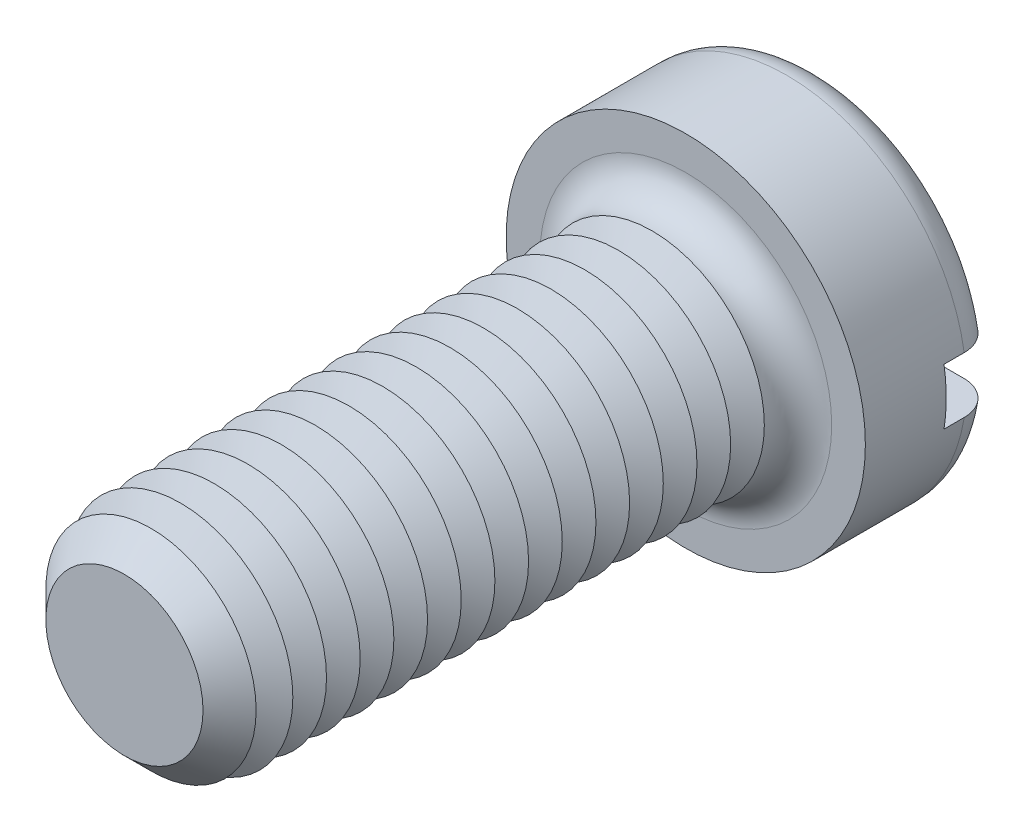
ISO-10303-21;
HEADER;
FILE_DESCRIPTION(('STEP AP214'),'2;1');
FILE_NAME('part.step','',(''),(''),'','','');
FILE_SCHEMA(('AUTOMOTIVE_DESIGN { 1 0 10303 214 1 1 1 1 }'));
ENDSEC;
DATA;
#1=APPLICATION_CONTEXT('core data for automotive mechanical design processes');
#2=APPLICATION_PROTOCOL_DEFINITION('international standard','automotive_design',2000,#1);
#3=PRODUCT_CONTEXT('',#1,'mechanical');
#4=PRODUCT('Part','Part','',(#3));
#5=PRODUCT_RELATED_PRODUCT_CATEGORY('part','',(#4));
#6=PRODUCT_DEFINITION_FORMATION('','',#4);
#7=PRODUCT_DEFINITION_CONTEXT('part definition',#1,'design');
#8=PRODUCT_DEFINITION('design','',#6,#7);
#9=PRODUCT_DEFINITION_SHAPE('','',#8);
#10=(LENGTH_UNIT() NAMED_UNIT(*) SI_UNIT(.MILLI.,.METRE.));
#11=(NAMED_UNIT(*) PLANE_ANGLE_UNIT() SI_UNIT($,.RADIAN.));
#12=(NAMED_UNIT(*) SI_UNIT($,.STERADIAN.) SOLID_ANGLE_UNIT());
#13=UNCERTAINTY_MEASURE_WITH_UNIT(LENGTH_MEASURE(1.E-05),#10,'distance_accuracy_value','');
#14=(GEOMETRIC_REPRESENTATION_CONTEXT(3) GLOBAL_UNCERTAINTY_ASSIGNED_CONTEXT((#13)) GLOBAL_UNIT_ASSIGNED_CONTEXT((#10,
#11,#12)) REPRESENTATION_CONTEXT('',''));
#15=CARTESIAN_POINT('',(0.,0.,0.));
#16=DIRECTION('',(0.,0.,1.));
#17=DIRECTION('',(1.,0.,0.));
#18=AXIS2_PLACEMENT_3D('',#15,#16,#17);
#19=CARTESIAN_POINT('',(0.,0.,-6.));
#20=DIRECTION('',(0.,0.,1.));
#21=DIRECTION('',(1.,0.,0.));
#22=AXIS2_PLACEMENT_3D('',#19,#20,#21);
#23=PLANE('',#22);
#24=CARTESIAN_POINT('',(0.,0.,-6.));
#25=DIRECTION('',(0.,0.,1.));
#26=DIRECTION('',(1.,0.,0.));
#27=AXIS2_PLACEMENT_3D('',#24,#25,#26);
#28=CIRCLE('',#27,6.5);
#29=CARTESIAN_POINT('',(-6.37867541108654,1.25,-6.));
#30=VERTEX_POINT('',#29);
#31=CARTESIAN_POINT('',(6.37867541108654,1.25,-6.));
#32=VERTEX_POINT('',#31);
#33=EDGE_CURVE('E116',#30,#32,#28,.F.);
#34=ORIENTED_EDGE('',*,*,#33,.T.);
#35=DIRECTION('',(1.,0.,0.));
#36=VECTOR('',#35,1.);
#37=CARTESIAN_POINT('',(-8.,1.25,-6.));
#38=LINE('',#37,#36);
#39=EDGE_CURVE('E111',#30,#32,#38,.T.);
#40=ORIENTED_EDGE('',*,*,#39,.F.);
#41=EDGE_LOOP('',(#34,#40));
#42=FACE_BOUND('',#41,.T.);
#43=ADVANCED_FACE('F39',(#42),#23,.F.);
#44=CARTESIAN_POINT('',(0.,0.,-4.5));
#45=DIRECTION('',(0.,0.,1.));
#46=DIRECTION('',(1.,0.,0.));
#47=AXIS2_PLACEMENT_3D('',#44,#45,#46);
#48=TOROIDAL_SURFACE('',#47,6.5,1.5);
#49=CARTESIAN_POINT('',(-7.63778128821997,1.25,-5.34492908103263));
#50=CARTESIAN_POINT('',(-7.58949199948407,1.25,-5.41482553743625));
#51=CARTESIAN_POINT('',(-7.53520056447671,1.25,-5.48065698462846));
#52=CARTESIAN_POINT('',(-7.41624971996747,1.25,-5.60228223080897));
#53=CARTESIAN_POINT('',(-7.35157642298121,1.25,-5.65806236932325));
#54=CARTESIAN_POINT('',(-7.21387612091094,1.25,-5.75795436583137));
#55=CARTESIAN_POINT('',(-7.14085828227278,1.25,-5.80207885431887));
#56=CARTESIAN_POINT('',(-6.98853766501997,1.25,-5.87758013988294));
#57=CARTESIAN_POINT('',(-6.90923642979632,1.25,-5.90896005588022));
#58=CARTESIAN_POINT('',(-6.74565677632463,1.25,-5.95849861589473));
#59=CARTESIAN_POINT('',(-6.66133328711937,1.25,-5.97650838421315));
#60=CARTESIAN_POINT('',(-6.49086565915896,1.25,-5.99833509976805));
#61=CARTESIAN_POINT('',(-6.40472129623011,1.25,-6.00215028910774));
#62=CARTESIAN_POINT('',(-6.23174891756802,1.25,-5.99550457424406));
#63=CARTESIAN_POINT('',(-6.14492874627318,1.25,-5.98483870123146));
#64=CARTESIAN_POINT('',(-5.97427268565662,1.25,-5.94920077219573));
#65=CARTESIAN_POINT('',(-5.89043699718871,1.25,-5.92422775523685));
#66=CARTESIAN_POINT('',(-5.72747580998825,1.25,-5.86041051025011));
#67=CARTESIAN_POINT('',(-5.64839123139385,1.25,-5.8214616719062));
#68=CARTESIAN_POINT('',(-5.49793182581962,1.25,-5.73076137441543));
#69=CARTESIAN_POINT('',(-5.42655700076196,1.25,-5.6790099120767));
#70=CARTESIAN_POINT('',(-5.29410028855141,1.25,-5.56444713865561));
#71=CARTESIAN_POINT('',(-5.23295591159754,1.25,-5.50170815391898));
#72=CARTESIAN_POINT('',(-5.12236155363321,1.25,-5.36664720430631));
#73=CARTESIAN_POINT('',(-5.07291010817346,1.25,-5.29432644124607));
#74=CARTESIAN_POINT('',(-4.98836421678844,1.25,-5.14389152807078));
#75=CARTESIAN_POINT('',(-4.95296843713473,1.25,-5.0659468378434));
#76=CARTESIAN_POINT('',(-4.89620356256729,1.25,-4.90510804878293));
#77=CARTESIAN_POINT('',(-4.87483169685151,1.25,-4.82221493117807));
#78=CARTESIAN_POINT('',(-4.8472995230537,1.25,-4.65636387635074));
#79=CARTESIAN_POINT('',(-4.84072446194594,1.25,-4.57347463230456));
#80=CARTESIAN_POINT('',(-4.84179430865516,1.25,-4.40779255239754));
#81=CARTESIAN_POINT('',(-4.84943782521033,1.25,-4.32499970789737));
#82=CARTESIAN_POINT('',(-4.87846819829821,1.25,-4.16301415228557));
#83=CARTESIAN_POINT('',(-4.89966978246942,1.25,-4.08378809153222));
#84=CARTESIAN_POINT('',(-4.95491528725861,1.25,-3.92995334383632));
#85=CARTESIAN_POINT('',(-4.98895983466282,1.25,-3.85534488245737));
#86=CARTESIAN_POINT('',(-5.06928242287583,1.25,-3.71183790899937));
#87=CARTESIAN_POINT('',(-5.11570495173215,1.25,-3.64302036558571));
#88=CARTESIAN_POINT('',(-5.21915370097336,1.25,-3.51388372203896));
#89=CARTESIAN_POINT('',(-5.27618132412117,1.25,-3.45356574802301));
#90=CARTESIAN_POINT('',(-5.40090076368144,1.25,-3.34137671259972));
#91=CARTESIAN_POINT('',(-5.46884305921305,1.25,-3.28978408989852));
#92=CARTESIAN_POINT('',(-5.61225757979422,1.25,-3.19841811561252));
#93=CARTESIAN_POINT('',(-5.68773079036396,1.25,-3.15864631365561));
#94=CARTESIAN_POINT('',(-5.84602026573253,1.25,-3.09111626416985));
#95=CARTESIAN_POINT('',(-5.92896901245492,1.25,-3.06366820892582));
#96=CARTESIAN_POINT('',(-6.09827849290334,1.25,-3.02294686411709));
#97=CARTESIAN_POINT('',(-6.18463944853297,1.25,-3.00967449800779));
#98=CARTESIAN_POINT('',(-6.35914138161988,1.25,-2.99765063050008));
#99=CARTESIAN_POINT('',(-6.4472913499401,1.25,-2.99902877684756));
#100=CARTESIAN_POINT('',(-6.62209547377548,1.25,-3.01665363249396));
#101=CARTESIAN_POINT('',(-6.70874965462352,1.25,-3.03290008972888));
#102=CARTESIAN_POINT('',(-6.87754008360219,1.25,-3.07975247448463));
#103=CARTESIAN_POINT('',(-6.95969991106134,1.25,-3.11027336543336));
#104=CARTESIAN_POINT('',(-7.11762200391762,1.25,-3.18486653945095));
#105=CARTESIAN_POINT('',(-7.19338469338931,1.25,-3.22893792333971));
#106=CARTESIAN_POINT('',(-7.33522754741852,1.25,-3.32873457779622));
#107=CARTESIAN_POINT('',(-7.40142768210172,1.25,-3.38428930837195));
#108=CARTESIAN_POINT('',(-7.52338344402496,1.25,-3.50587739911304));
#109=CARTESIAN_POINT('',(-7.5791399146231,1.25,-3.57190991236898));
#110=CARTESIAN_POINT('',(-7.67774856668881,1.25,-3.71151097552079));
#111=CARTESIAN_POINT('',(-7.72078137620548,1.25,-3.7849519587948));
#112=CARTESIAN_POINT('',(-7.79373860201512,1.25,-3.93807617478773));
#113=CARTESIAN_POINT('',(-7.82366445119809,1.25,-4.01775872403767));
#114=CARTESIAN_POINT('',(-7.86922494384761,1.25,-4.1801114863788));
#115=CARTESIAN_POINT('',(-7.88502105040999,1.25,-4.26273642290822));
#116=CARTESIAN_POINT('',(-7.90243332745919,1.25,-4.42948977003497));
#117=CARTESIAN_POINT('',(-7.90404643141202,1.25,-4.51361850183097));
#118=CARTESIAN_POINT('',(-7.89306914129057,1.25,-4.68049925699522));
#119=CARTESIAN_POINT('',(-7.88055163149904,1.25,-4.76325613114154));
#120=CARTESIAN_POINT('',(-7.84181179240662,1.25,-4.92542124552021));
#121=CARTESIAN_POINT('',(-7.81560657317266,1.25,-5.00483353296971));
#122=CARTESIAN_POINT('',(-7.76329893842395,1.25,-5.12766777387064));
#123=CARTESIAN_POINT('',(-7.74127773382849,1.25,-5.17287245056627));
#124=CARTESIAN_POINT('',(-7.69279783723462,1.25,-5.26083500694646));
#125=CARTESIAN_POINT('',(-7.66633917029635,1.25,-5.30359290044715));
#126=CARTESIAN_POINT('',(-7.63778128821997,1.25,-5.34492908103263));
#127=B_SPLINE_CURVE_WITH_KNOTS('',3,(#49,#50,#51,#52,#53,#54,#55,#56,#57,#58,#59,#60,#61,#62,
#63,#64,#65,#66,#67,#68,#69,#70,#71,#72,#73,#74,#75,#76,#77,#78,#79,#80,#81,#82,#83,#84,#85,#86,
#87,#88,#89,#90,#91,#92,#93,#94,#95,#96,#97,#98,#99,#100,#101,#102,#103,#104,#105,#106,#107,
#108,#109,#110,#111,#112,#113,#114,#115,#116,#117,#118,#119,#120,#121,#122,#123,#124,#125,#126),
.UNSPECIFIED.,.T.,.F.,(4,2,2,2,2,2,2,2,2,2,2,2,2,2,2,2,2,2,2,2,2,2,2,2,2,2,2,2,2,2,2,2,2,2,2,2,
2,2,4),(0.,0.254678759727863,0.509701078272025,0.764445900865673,1.01912834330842,
1.27660578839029,1.53411511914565,1.7953075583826,2.05651754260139,2.31972495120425,
2.58293242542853,2.84446831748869,3.10597143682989,3.36151874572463,3.61701554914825,
3.86525656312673,4.11347328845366,4.35836855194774,4.60327576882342,4.8511774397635,
5.0991119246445,5.35387584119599,5.60867314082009,5.86956650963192,6.13047687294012,
6.39369803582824,6.65691473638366,6.91858297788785,7.18023385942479,7.43824706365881,
7.69623942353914,7.95037087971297,8.20447454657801,8.45563599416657,8.70685174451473,
8.95677764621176,9.20639187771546,9.35700761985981,9.50762251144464),.UNSPECIFIED.);
#128=CARTESIAN_POINT('',(-7.90174031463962,1.25,-4.50000000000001));
#129=VERTEX_POINT('',#128);
#130=EDGE_CURVE('E305',#129,#30,#127,.T.);
#131=ORIENTED_EDGE('',*,*,#130,.F.);
#132=CARTESIAN_POINT('',(0.,0.,-4.5));
#133=DIRECTION('',(0.,0.,1.));
#134=DIRECTION('',(1.,0.,0.));
#135=AXIS2_PLACEMENT_3D('',#132,#133,#134);
#136=CIRCLE('',#135,8.);
#137=CARTESIAN_POINT('',(7.90174031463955,1.25,-4.5));
#138=VERTEX_POINT('',#137);
#139=EDGE_CURVE('E125',#138,#129,#136,.T.);
#140=ORIENTED_EDGE('',*,*,#139,.F.);
#141=CARTESIAN_POINT('',(4.95236709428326,1.25,-5.05808354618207));
#142=CARTESIAN_POINT('',(4.98477386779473,1.25,-5.13646278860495));
#143=CARTESIAN_POINT('',(5.02397623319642,1.25,-5.21210974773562));
#144=CARTESIAN_POINT('',(5.11464829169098,1.25,-5.35575180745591));
#145=CARTESIAN_POINT('',(5.16613670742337,1.25,-5.42373499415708));
#146=CARTESIAN_POINT('',(5.27963080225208,1.25,-5.55005899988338));
#147=CARTESIAN_POINT('',(5.34161871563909,1.25,-5.60841578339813));
#148=CARTESIAN_POINT('',(5.47431803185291,1.25,-5.71412381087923));
#149=CARTESIAN_POINT('',(5.545027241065,1.25,-5.76147781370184));
#150=CARTESIAN_POINT('',(5.69469818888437,1.25,-5.84486022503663));
#151=CARTESIAN_POINT('',(5.77379661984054,1.25,-5.88064336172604));
#152=CARTESIAN_POINT('',(5.93682776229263,1.25,-5.93863952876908));
#153=CARTESIAN_POINT('',(6.02076112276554,1.25,-5.96085073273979));
#154=CARTESIAN_POINT('',(6.19235911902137,1.25,-5.99130732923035));
#155=CARTESIAN_POINT('',(6.2800597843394,1.25,-5.99935025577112));
#156=CARTESIAN_POINT('',(6.45556807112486,1.25,-6.00057400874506));
#157=CARTESIAN_POINT('',(6.54337569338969,1.25,-5.99375472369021));
#158=CARTESIAN_POINT('',(6.71642471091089,1.25,-5.96539034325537));
#159=CARTESIAN_POINT('',(6.8016703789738,1.25,-5.94387137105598));
#160=CARTESIAN_POINT('',(6.96726399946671,1.25,-5.8866508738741));
#161=CARTESIAN_POINT('',(7.04761223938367,1.25,-5.85095018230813));
#162=CARTESIAN_POINT('',(7.2000703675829,1.25,-5.7668235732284));
#163=CARTESIAN_POINT('',(7.27226868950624,1.25,-5.71855796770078));
#164=CARTESIAN_POINT('',(7.40737382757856,1.25,-5.61041520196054));
#165=CARTESIAN_POINT('',(7.47028138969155,1.25,-5.55053897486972));
#166=CARTESIAN_POINT('',(7.5840004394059,1.25,-5.42185995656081));
#167=CARTESIAN_POINT('',(7.63498189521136,1.25,-5.35320736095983));
#168=CARTESIAN_POINT('',(7.72451646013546,1.25,-5.20822613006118));
#169=CARTESIAN_POINT('',(7.76307051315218,1.25,-5.13189807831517));
#170=CARTESIAN_POINT('',(7.82615156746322,1.25,-4.97479919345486));
#171=CARTESIAN_POINT('',(7.85085353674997,1.25,-4.89409858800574));
#172=CARTESIAN_POINT('',(7.88624162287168,1.25,-4.72968126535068));
#173=CARTESIAN_POINT('',(7.89692844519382,1.25,-4.64596470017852));
#174=CARTESIAN_POINT('',(7.90393395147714,1.25,-4.47857496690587));
#175=CARTESIAN_POINT('',(7.900361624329,1.25,-4.39490633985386));
#176=CARTESIAN_POINT('',(7.8792027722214,1.25,-4.22936201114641));
#177=CARTESIAN_POINT('',(7.86161649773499,1.25,-4.14748627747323));
#178=CARTESIAN_POINT('',(7.81298565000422,1.25,-3.98793539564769));
#179=CARTESIAN_POINT('',(7.78195585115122,1.25,-3.91025574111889));
#180=CARTESIAN_POINT('',(7.70736418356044,1.25,-3.76116938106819));
#181=CARTESIAN_POINT('',(7.66380211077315,1.25,-3.68976277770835));
#182=CARTESIAN_POINT('',(7.56515173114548,1.25,-3.55480889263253));
#183=CARTESIAN_POINT('',(7.51000119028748,1.25,-3.49130712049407));
#184=CARTESIAN_POINT('',(7.38992820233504,1.25,-3.3743390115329));
#185=CARTESIAN_POINT('',(7.32500529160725,1.25,-3.32087315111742));
#186=CARTESIAN_POINT('',(7.18646521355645,1.25,-3.22483712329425));
#187=CARTESIAN_POINT('',(7.11275872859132,1.25,-3.18239583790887));
#188=CARTESIAN_POINT('',(6.95934489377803,1.25,-3.11028530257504));
#189=CARTESIAN_POINT('',(6.87963710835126,1.25,-3.08061698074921));
#190=CARTESIAN_POINT('',(6.71523243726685,1.25,-3.03442872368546));
#191=CARTESIAN_POINT('',(6.63047940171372,1.25,-3.0181086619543));
#192=CARTESIAN_POINT('',(6.45944163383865,1.25,-2.99971307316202));
#193=CARTESIAN_POINT('',(6.37315677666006,1.25,-2.99763871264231));
#194=CARTESIAN_POINT('',(6.20021063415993,1.25,-3.00779604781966));
#195=CARTESIAN_POINT('',(6.11356117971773,1.25,-3.02022976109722));
#196=CARTESIAN_POINT('',(5.94354092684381,1.25,-3.05935975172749));
#197=CARTESIAN_POINT('',(5.86017035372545,1.25,-3.08605700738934));
#198=CARTESIAN_POINT('',(5.69848536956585,1.25,-3.15322746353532));
#199=CARTESIAN_POINT('',(5.62021039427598,1.25,-3.1937956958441));
#200=CARTESIAN_POINT('',(5.47164170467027,1.25,-3.28758816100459));
#201=CARTESIAN_POINT('',(5.40134797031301,1.25,-3.3408123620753));
#202=CARTESIAN_POINT('',(5.27136483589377,1.25,-3.45806317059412));
#203=CARTESIAN_POINT('',(5.21160120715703,1.25,-3.52200740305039));
#204=CARTESIAN_POINT('',(5.10396941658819,1.25,-3.65922833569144));
#205=CARTESIAN_POINT('',(5.05609917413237,1.25,-3.73250340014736));
#206=CARTESIAN_POINT('',(4.97487058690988,1.25,-3.8844714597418));
#207=CARTESIAN_POINT('',(4.94119529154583,1.25,-3.96299495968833));
#208=CARTESIAN_POINT('',(4.88793322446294,1.25,-4.12470694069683));
#209=CARTESIAN_POINT('',(4.86834741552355,1.25,-4.20789574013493));
#210=CARTESIAN_POINT('',(4.84433446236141,1.25,-4.3740749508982));
#211=CARTESIAN_POINT('',(4.83950391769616,1.25,-4.45700748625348));
#212=CARTESIAN_POINT('',(4.84404021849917,1.25,-4.62240731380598));
#213=CARTESIAN_POINT('',(4.85338770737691,1.25,-4.70487508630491));
#214=CARTESIAN_POINT('',(4.87895619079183,1.25,-4.83246978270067));
#215=CARTESIAN_POINT('',(4.89056704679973,1.25,-4.87856970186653));
#216=CARTESIAN_POINT('',(4.91819711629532,1.25,-4.96942661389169));
#217=CARTESIAN_POINT('',(4.93421619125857,1.25,-5.01418364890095));
#218=CARTESIAN_POINT('',(4.95236709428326,1.25,-5.05808354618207));
#219=B_SPLINE_CURVE_WITH_KNOTS('',3,(#141,#142,#143,#144,#145,#146,#147,#148,#149,#150,#151,
#152,#153,#154,#155,#156,#157,#158,#159,#160,#161,#162,#163,#164,#165,#166,#167,#168,#169,#170,
#171,#172,#173,#174,#175,#176,#177,#178,#179,#180,#181,#182,#183,#184,#185,#186,#187,#188,#189,
#190,#191,#192,#193,#194,#195,#196,#197,#198,#199,#200,#201,#202,#203,#204,#205,#206,#207,#208,
#209,#210,#211,#212,#213,#214,#215,#216,#217,#218),.UNSPECIFIED.,.T.,.F.,(4,2,2,2,2,2,2,2,2,2,2,
2,2,2,2,2,2,2,2,2,2,2,2,2,2,2,2,2,2,2,2,2,2,2,2,2,2,2,4),(0.,0.25426396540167,0.508917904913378,
0.763145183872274,1.01730864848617,1.27655188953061,1.53583000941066,1.79878406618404,
2.06174009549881,2.32423003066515,2.5867045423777,2.84598168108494,3.10523799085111,
3.36053725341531,3.61581712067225,3.8677953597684,4.11976091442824,4.36980428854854,
4.61984319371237,4.86960800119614,5.11937687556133,5.37052303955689,5.62168112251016,
5.87565515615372,6.12964764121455,6.38737709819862,6.64512765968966,6.90651052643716,
7.16791132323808,7.43114013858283,7.69436829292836,7.95565940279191,8.21690477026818,
8.47196060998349,8.72703387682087,8.97506819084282,9.22276418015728,9.36518087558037,
9.50759309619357),.UNSPECIFIED.);
#220=EDGE_CURVE('E307',#32,#138,#219,.T.);
#221=ORIENTED_EDGE('',*,*,#220,.F.);
#222=ORIENTED_EDGE('',*,*,#33,.F.);
#223=EDGE_LOOP('',(#131,#140,#221,#222));
#224=FACE_BOUND('',#223,.T.);
#225=ADVANCED_FACE('F289',(#224),#48,.T.);
#226=CARTESIAN_POINT('',(0.,0.,-6.));
#227=DIRECTION('',(0.,0.,1.));
#228=DIRECTION('',(1.,0.,0.));
#229=AXIS2_PLACEMENT_3D('',#226,#227,#228);
#230=CYLINDRICAL_SURFACE('',#229,8.);
#231=DIRECTION('',(0.,0.,1.));
#232=VECTOR('',#231,1.);
#233=CARTESIAN_POINT('',(7.90174031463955,1.25,-6.));
#234=LINE('',#233,#232);
#235=CARTESIAN_POINT('',(7.90174031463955,1.25,-3.6));
#236=VERTEX_POINT('',#235);
#237=EDGE_CURVE('E323',#138,#236,#234,.T.);
#238=ORIENTED_EDGE('',*,*,#237,.F.);
#239=ORIENTED_EDGE('',*,*,#139,.T.);
#240=DIRECTION('',(0.,0.,1.));
#241=VECTOR('',#240,1.);
#242=CARTESIAN_POINT('',(-7.90174031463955,1.25,-6.));
#243=LINE('',#242,#241);
#244=CARTESIAN_POINT('',(-7.90174031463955,1.25,-3.6));
#245=VERTEX_POINT('',#244);
#246=EDGE_CURVE('E63',#245,#129,#243,.F.);
#247=ORIENTED_EDGE('',*,*,#246,.F.);
#248=CARTESIAN_POINT('',(0.,0.,-3.6));
#249=DIRECTION('',(0.,0.,-1.));
#250=DIRECTION('',(-1.,0.,0.));
#251=AXIS2_PLACEMENT_3D('',#248,#249,#250);
#252=CIRCLE('',#251,8.);
#253=CARTESIAN_POINT('',(-7.90174031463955,-1.25,-3.6));
#254=VERTEX_POINT('',#253);
#255=EDGE_CURVE('E43',#245,#254,#252,.F.);
#256=ORIENTED_EDGE('',*,*,#255,.T.);
#257=DIRECTION('',(0.,0.,1.));
#258=VECTOR('',#257,1.);
#259=CARTESIAN_POINT('',(-7.90174031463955,-1.25,-6.));
#260=LINE('',#259,#258);
#261=CARTESIAN_POINT('',(-7.9017403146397,-1.25,-4.49999999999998));
#262=VERTEX_POINT('',#261);
#263=EDGE_CURVE('E320',#262,#254,#260,.T.);
#264=ORIENTED_EDGE('',*,*,#263,.F.);
#265=CARTESIAN_POINT('',(7.90174031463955,-1.25,-4.5));
#266=VERTEX_POINT('',#265);
#267=EDGE_CURVE('E127',#262,#266,#136,.T.);
#268=ORIENTED_EDGE('',*,*,#267,.T.);
#269=DIRECTION('',(0.,0.,1.));
#270=VECTOR('',#269,1.);
#271=CARTESIAN_POINT('',(7.90174031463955,-1.25,-6.));
#272=LINE('',#271,#270);
#273=CARTESIAN_POINT('',(7.90174031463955,-1.25,-3.6));
#274=VERTEX_POINT('',#273);
#275=EDGE_CURVE('E55',#274,#266,#272,.F.);
#276=ORIENTED_EDGE('',*,*,#275,.F.);
#277=EDGE_CURVE('E11',#274,#236,#252,.F.);
#278=ORIENTED_EDGE('',*,*,#277,.T.);
#279=EDGE_LOOP('',(#238,#239,#247,#256,#264,#268,#276,#278));
#280=FACE_BOUND('',#279,.T.);
#281=CARTESIAN_POINT('',(0.,0.,0.));
#282=DIRECTION('',(0.,0.,1.));
#283=DIRECTION('',(1.,0.,0.));
#284=AXIS2_PLACEMENT_3D('',#281,#282,#283);
#285=CIRCLE('',#284,8.);
#286=CARTESIAN_POINT('',(8.,0.,0.));
#287=VERTEX_POINT('',#286);
#288=EDGE_CURVE('E325',#287,#287,#285,.T.);
#289=ORIENTED_EDGE('',*,*,#288,.F.);
#290=EDGE_LOOP('',(#289));
#291=FACE_BOUND('',#290,.T.);
#292=ADVANCED_FACE('F285',(#280,#291),#230,.T.);
#293=CARTESIAN_POINT('',(6.37867541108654,-1.25,-6.));
#294=VERTEX_POINT('',#293);
#295=CARTESIAN_POINT('',(-6.37867541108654,-1.25,-6.));
#296=VERTEX_POINT('',#295);
#297=EDGE_CURVE('E109',#294,#296,#28,.F.);
#298=ORIENTED_EDGE('',*,*,#297,.T.);
#299=DIRECTION('',(-1.,0.,0.));
#300=VECTOR('',#299,1.);
#301=CARTESIAN_POINT('',(-8.,-1.25,-6.));
#302=LINE('',#301,#300);
#303=EDGE_CURVE('E96',#294,#296,#302,.T.);
#304=ORIENTED_EDGE('',*,*,#303,.F.);
#305=EDGE_LOOP('',(#298,#304));
#306=FACE_BOUND('',#305,.T.);
#307=ADVANCED_FACE('F108',(#306),#23,.F.);
#308=CARTESIAN_POINT('',(0.,0.,0.));
#309=DIRECTION('',(0.,0.,1.));
#310=DIRECTION('',(1.,0.,0.));
#311=AXIS2_PLACEMENT_3D('',#308,#309,#310);
#312=PLANE('',#311);
#313=CARTESIAN_POINT('',(0.,0.,0.));
#314=DIRECTION('',(0.,0.,1.));
#315=DIRECTION('',(1.,0.,0.));
#316=AXIS2_PLACEMENT_3D('',#313,#314,#315);
#317=CIRCLE('',#316,6.5);
#318=CARTESIAN_POINT('',(6.5,0.,0.));
#319=VERTEX_POINT('',#318);
#320=EDGE_CURVE('E115',#319,#319,#317,.F.);
#321=ORIENTED_EDGE('',*,*,#320,.T.);
#322=EDGE_LOOP('',(#321));
#323=FACE_BOUND('',#322,.T.);
#324=ORIENTED_EDGE('',*,*,#288,.T.);
#325=EDGE_LOOP('',(#324));
#326=FACE_BOUND('',#325,.T.);
#327=ADVANCED_FACE('F284',(#323,#326),#312,.T.);
#328=CARTESIAN_POINT('',(-7.63778128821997,-1.25,-5.34492908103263));
#329=CARTESIAN_POINT('',(-7.68527581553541,-1.25,-5.27616964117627));
#330=CARTESIAN_POINT('',(-7.72703224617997,-1.25,-5.20337764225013));
#331=CARTESIAN_POINT('',(-7.79778035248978,-1.25,-5.05176511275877));
#332=CARTESIAN_POINT('',(-7.82675823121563,-1.25,-4.97293817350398));
#333=CARTESIAN_POINT('',(-7.87103239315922,-1.25,-4.81153865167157));
#334=CARTESIAN_POINT('',(-7.8863313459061,-1.25,-4.72896680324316));
#335=CARTESIAN_POINT('',(-7.90278562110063,-1.25,-4.56244566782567));
#336=CARTESIAN_POINT('',(-7.90394420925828,-1.25,-4.4784967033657));
#337=CARTESIAN_POINT('',(-7.89211470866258,-1.25,-4.31190980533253));
#338=CARTESIAN_POINT('',(-7.87917806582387,-1.25,-4.22926821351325));
#339=CARTESIAN_POINT('',(-7.8396278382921,-1.25,-4.06732477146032));
#340=CARTESIAN_POINT('',(-7.81301388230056,-1.25,-3.98802301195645));
#341=CARTESIAN_POINT('',(-7.74686575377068,-1.25,-3.83490116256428));
#342=CARTESIAN_POINT('',(-7.70731700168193,-1.25,-3.76108737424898));
#343=CARTESIAN_POINT('',(-7.61647675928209,-1.25,-3.62108231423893));
#344=CARTESIAN_POINT('',(-7.56518496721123,-1.25,-3.55489123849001));
#345=CARTESIAN_POINT('',(-7.45192141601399,-1.25,-3.43145488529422));
#346=CARTESIAN_POINT('',(-7.3898717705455,-1.25,-3.37428109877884));
#347=CARTESIAN_POINT('',(-7.25715883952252,-1.25,-3.27100737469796));
#348=CARTESIAN_POINT('',(-7.18649507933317,-1.25,-3.22490804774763));
#349=CARTESIAN_POINT('',(-7.03760898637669,-1.25,-3.14445316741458));
#350=CARTESIAN_POINT('',(-6.95930204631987,-1.25,-3.1102542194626));
#351=CARTESIAN_POINT('',(-6.79811453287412,-1.25,-3.05526915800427));
#352=CARTESIAN_POINT('',(-6.71523359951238,-1.25,-3.03448410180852));
#353=CARTESIAN_POINT('',(-6.5459165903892,-1.25,-3.006592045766));
#354=CARTESIAN_POINT('',(-6.45944575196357,-1.25,-2.99969602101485));
#355=CARTESIAN_POINT('',(-6.28655568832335,-1.25,-3.00032465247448));
#356=CARTESIAN_POINT('',(-6.20013646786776,-1.25,-3.00785047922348));
#357=CARTESIAN_POINT('',(-6.02865505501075,-1.25,-3.03725742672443));
#358=CARTESIAN_POINT('',(-5.94362352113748,-1.25,-3.05931758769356));
#359=CARTESIAN_POINT('',(-5.77844448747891,-1.25,-3.11735373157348));
#360=CARTESIAN_POINT('',(-5.69829723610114,-1.25,-3.15333042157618));
#361=CARTESIAN_POINT('',(-5.54495924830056,-1.25,-3.23837037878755));
#362=CARTESIAN_POINT('',(-5.47178958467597,-1.25,-3.28747168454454));
#363=CARTESIAN_POINT('',(-5.33486536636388,-1.25,-3.39741183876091));
#364=CARTESIAN_POINT('',(-5.27111040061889,-1.25,-3.45825017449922));
#365=CARTESIAN_POINT('',(-5.15579778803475,-1.25,-3.58914722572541));
#366=CARTESIAN_POINT('',(-5.10409113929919,-1.25,-3.65907455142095));
#367=CARTESIAN_POINT('',(-5.01353659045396,-1.25,-3.8068142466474));
#368=CARTESIAN_POINT('',(-4.97468647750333,-1.25,-3.88462525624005));
#369=CARTESIAN_POINT('',(-4.91208858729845,-1.25,-4.04366636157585));
#370=CARTESIAN_POINT('',(-4.88795969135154,-1.25,-4.12474643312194));
#371=CARTESIAN_POINT('',(-4.85404909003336,-1.25,-4.28985038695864));
#372=CARTESIAN_POINT('',(-4.84426486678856,-1.25,-4.37387374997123));
#373=CARTESIAN_POINT('',(-4.83946276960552,-1.25,-4.54023897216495));
#374=CARTESIAN_POINT('',(-4.8440833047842,-1.25,-4.62257060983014));
#375=CARTESIAN_POINT('',(-4.86713763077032,-1.25,-4.78527148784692));
#376=CARTESIAN_POINT('',(-4.88557092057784,-1.25,-4.86564079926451));
#377=CARTESIAN_POINT('',(-4.9355229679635,-1.25,-5.02189555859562));
#378=CARTESIAN_POINT('',(-4.9669975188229,-1.25,-5.09779517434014));
#379=CARTESIAN_POINT('',(-5.04199393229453,-1.25,-5.24338322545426));
#380=CARTESIAN_POINT('',(-5.0855168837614,-1.25,-5.31307109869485));
#381=CARTESIAN_POINT('',(-5.18427540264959,-1.25,-5.44580979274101));
#382=CARTESIAN_POINT('',(-5.2397318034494,-1.25,-5.50869620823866));
#383=CARTESIAN_POINT('',(-5.36015301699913,-1.25,-5.62458635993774));
#384=CARTESIAN_POINT('',(-5.42511919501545,-1.25,-5.67758867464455));
#385=CARTESIAN_POINT('',(-5.56469412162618,-1.25,-5.7737610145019));
#386=CARTESIAN_POINT('',(-5.6395232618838,-1.25,-5.81661133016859));
#387=CARTESIAN_POINT('',(-5.79521544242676,-1.25,-5.8894110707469));
#388=CARTESIAN_POINT('',(-5.8760791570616,-1.25,-5.91935905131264));
#389=CARTESIAN_POINT('',(-6.04317815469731,-1.25,-5.9660059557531));
#390=CARTESIAN_POINT('',(-6.12948555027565,-1.25,-5.98244700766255));
#391=CARTESIAN_POINT('',(-6.30363462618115,-1.25,-6.00064866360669));
#392=CARTESIAN_POINT('',(-6.39147629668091,-1.25,-6.00240936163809));
#393=CARTESIAN_POINT('',(-6.5664192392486,-1.25,-5.9911248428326));
#394=CARTESIAN_POINT('',(-6.653518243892,-1.25,-5.9780442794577));
#395=CARTESIAN_POINT('',(-6.82426167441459,-1.25,-5.93729204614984));
#396=CARTESIAN_POINT('',(-6.90790538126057,-1.25,-5.90961735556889));
#397=CARTESIAN_POINT('',(-7.06846412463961,-1.25,-5.84071272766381));
#398=CARTESIAN_POINT('',(-7.14543542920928,-1.25,-5.79961377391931));
#399=CARTESIAN_POINT('',(-7.29116896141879,-1.25,-5.70491210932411));
#400=CARTESIAN_POINT('',(-7.35994165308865,-1.25,-5.65132560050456));
#401=CARTESIAN_POINT('',(-7.46362894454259,-1.25,-5.55509815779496));
#402=CARTESIAN_POINT('',(-7.50165191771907,-1.25,-5.51575032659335));
#403=CARTESIAN_POINT('',(-7.57319530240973,-1.25,-5.43315308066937));
#404=CARTESIAN_POINT('',(-7.60671575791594,-1.25,-5.38990370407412));
#405=CARTESIAN_POINT('',(-7.63778128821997,-1.25,-5.34492908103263));
#406=B_SPLINE_CURVE_WITH_KNOTS('',3,(#328,#329,#330,#331,#332,#333,#334,#335,#336,#337,#338,
#339,#340,#341,#342,#343,#344,#345,#346,#347,#348,#349,#350,#351,#352,#353,#354,#355,#356,#357,
#358,#359,#360,#361,#362,#363,#364,#365,#366,#367,#368,#369,#370,#371,#372,#373,#374,#375,#376,
#377,#378,#379,#380,#381,#382,#383,#384,#385,#386,#387,#388,#389,#390,#391,#392,#393,#394,#395,
#396,#397,#398,#399,#400,#401,#402,#403,#404,#405),.UNSPECIFIED.,.T.,.F.,(4,2,2,2,2,2,2,2,2,2,2,
2,2,2,2,2,2,2,2,2,2,2,2,2,2,2,2,2,2,2,2,2,2,2,2,2,2,2,4),(0.,0.250506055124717,
0.501281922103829,0.752008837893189,1.00267784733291,1.25243500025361,1.50219893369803,
1.75224536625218,2.00229822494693,2.25424343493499,2.50620253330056,2.76136198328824,
3.01654154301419,3.27556891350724,3.53461730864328,3.79691797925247,4.05923197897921,
4.32231463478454,4.5853858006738,4.84500678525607,5.10458306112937,5.3571172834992,
5.60960717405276,5.85581050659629,6.10200490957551,6.34737151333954,6.59276029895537,
6.84315522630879,7.09358613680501,7.35108485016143,7.60861238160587,7.87094926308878,
8.13328446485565,8.39624576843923,8.65926152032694,8.91978401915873,9.17997036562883,
9.34382460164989,9.50767723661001),.UNSPECIFIED.);
#407=EDGE_CURVE('E103',#296,#262,#406,.T.);
#408=ORIENTED_EDGE('',*,*,#407,.F.);
#409=ORIENTED_EDGE('',*,*,#297,.F.);
#410=CARTESIAN_POINT('',(4.95236709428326,-1.25,-5.05808354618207));
#411=CARTESIAN_POINT('',(4.92105512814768,-1.25,-4.98233216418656));
#412=CARTESIAN_POINT('',(4.89604361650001,-1.25,-4.90392040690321));
#413=CARTESIAN_POINT('',(4.85951223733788,-1.25,-4.74395758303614));
#414=CARTESIAN_POINT('',(4.8480045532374,-1.25,-4.66240375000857));
#415=CARTESIAN_POINT('',(4.83891469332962,-1.25,-4.49852199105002));
#416=CARTESIAN_POINT('',(4.84133145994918,-1.25,-4.41619412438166));
#417=CARTESIAN_POINT('',(4.8600038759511,-1.25,-4.25314313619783));
#418=CARTESIAN_POINT('',(4.87625705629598,-1.25,-4.17241973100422));
#419=CARTESIAN_POINT('',(4.92196554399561,-1.25,-4.01505032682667));
#420=CARTESIAN_POINT('',(4.95138456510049,-1.25,-3.93839376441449));
#421=CARTESIAN_POINT('',(5.02244158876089,-1.25,-3.79097367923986));
#422=CARTESIAN_POINT('',(5.06408092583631,-1.25,-3.72021080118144));
#423=CARTESIAN_POINT('',(5.15918188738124,-1.25,-3.5851203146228));
#424=CARTESIAN_POINT('',(5.21285223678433,-1.25,-3.5209397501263));
#425=CARTESIAN_POINT('',(5.32993512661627,-1.25,-3.40218700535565));
#426=CARTESIAN_POINT('',(5.39334903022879,-1.25,-3.34761617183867));
#427=CARTESIAN_POINT('',(5.5300552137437,-1.25,-3.24801679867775));
#428=CARTESIAN_POINT('',(5.60357647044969,-1.25,-3.20330242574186));
#429=CARTESIAN_POINT('',(5.75697062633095,-1.25,-3.1265687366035));
#430=CARTESIAN_POINT('',(5.83684424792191,-1.25,-3.09455086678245));
#431=CARTESIAN_POINT('',(6.00239031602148,-1.25,-3.04353393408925));
#432=CARTESIAN_POINT('',(6.08814636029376,-1.25,-3.02480570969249));
#433=CARTESIAN_POINT('',(6.26158564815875,-1.25,-3.00194915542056));
#434=CARTESIAN_POINT('',(6.34926896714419,-1.25,-2.997821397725));
#435=CARTESIAN_POINT('',(6.52441816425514,-1.25,-3.00435236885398));
#436=CARTESIAN_POINT('',(6.61188199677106,-1.25,-3.01506655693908));
#437=CARTESIAN_POINT('',(6.78373130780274,-1.25,-3.05116556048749));
#438=CARTESIAN_POINT('',(6.8681168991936,-1.25,-3.07654983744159));
#439=CARTESIAN_POINT('',(7.03056473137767,-1.25,-3.14105639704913));
#440=CARTESIAN_POINT('',(7.10867812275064,-1.25,-3.18004978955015));
#441=CARTESIAN_POINT('',(7.25711285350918,-1.25,-3.27078804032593));
#442=CARTESIAN_POINT('',(7.327434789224,-1.25,-3.32253192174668));
#443=CARTESIAN_POINT('',(7.45716954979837,-1.25,-3.4364775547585));
#444=CARTESIAN_POINT('',(7.51672925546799,-1.25,-3.49851206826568));
#445=CARTESIAN_POINT('',(7.62440498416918,-1.25,-3.63182557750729));
#446=CARTESIAN_POINT('',(7.67252193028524,-1.25,-3.70310382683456));
#447=CARTESIAN_POINT('',(7.75523498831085,-1.25,-3.8517825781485));
#448=CARTESIAN_POINT('',(7.79001407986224,-1.25,-3.92908131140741));
#449=CARTESIAN_POINT('',(7.84595474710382,-1.25,-4.08845836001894));
#450=CARTESIAN_POINT('',(7.86711715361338,-1.25,-4.1705363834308));
#451=CARTESIAN_POINT('',(7.89503817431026,-1.25,-4.3362768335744));
#452=CARTESIAN_POINT('',(7.90193595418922,-1.25,-4.41991584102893));
#453=CARTESIAN_POINT('',(7.90153623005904,-1.25,-4.58715860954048));
#454=CARTESIAN_POINT('',(7.89423915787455,-1.25,-4.67076237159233));
#455=CARTESIAN_POINT('',(7.86572271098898,-1.25,-4.83525080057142));
#456=CARTESIAN_POINT('',(7.84455307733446,-1.25,-4.91614410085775));
#457=CARTESIAN_POINT('',(7.78897430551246,-1.25,-5.0732444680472));
#458=CARTESIAN_POINT('',(7.75456511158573,-1.25,-5.1494515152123));
#459=CARTESIAN_POINT('',(7.67339923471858,-1.25,-5.29528903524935));
#460=CARTESIAN_POINT('',(7.62660424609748,-1.25,-5.36489817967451));
#461=CARTESIAN_POINT('',(7.52209201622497,-1.25,-5.49536318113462));
#462=CARTESIAN_POINT('',(7.4643743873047,-1.25,-5.55621872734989));
#463=CARTESIAN_POINT('',(7.33909994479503,-1.25,-5.66807257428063));
#464=CARTESIAN_POINT('',(7.27145672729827,-1.25,-5.71897407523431));
#465=CARTESIAN_POINT('',(7.12868060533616,-1.25,-5.80887807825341));
#466=CARTESIAN_POINT('',(7.0535472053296,-1.25,-5.84787979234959));
#467=CARTESIAN_POINT('',(6.89682225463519,-1.25,-5.91345911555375));
#468=CARTESIAN_POINT('',(6.81515596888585,-1.25,-5.93985808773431));
#469=CARTESIAN_POINT('',(6.64858434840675,-1.25,-5.97879449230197));
#470=CARTESIAN_POINT('',(6.56367874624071,-1.25,-5.99133077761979));
#471=CARTESIAN_POINT('',(6.39168259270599,-1.25,-6.00236627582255));
#472=CARTESIAN_POINT('',(6.30457835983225,-1.25,-6.00065255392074));
#473=CARTESIAN_POINT('',(6.13186422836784,-1.25,-5.98278857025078));
#474=CARTESIAN_POINT('',(6.04625438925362,-1.25,-5.96663773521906));
#475=CARTESIAN_POINT('',(5.87802521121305,-1.25,-5.92012173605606));
#476=CARTESIAN_POINT('',(5.79544617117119,-1.25,-5.88961066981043));
#477=CARTESIAN_POINT('',(5.63656223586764,-1.25,-5.81513349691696));
#478=CARTESIAN_POINT('',(5.56025908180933,-1.25,-5.77116367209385));
#479=CARTESIAN_POINT('',(5.4162607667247,-1.25,-5.67098882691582));
#480=CARTESIAN_POINT('',(5.34855795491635,-1.25,-5.61479480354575));
#481=CARTESIAN_POINT('',(5.22382615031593,-1.25,-5.49168804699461));
#482=CARTESIAN_POINT('',(5.16678340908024,-1.25,-5.42478932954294));
#483=CARTESIAN_POINT('',(5.08326589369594,-1.25,-5.3075481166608));
#484=CARTESIAN_POINT('',(5.05313168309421,-1.25,-5.25976959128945));
#485=CARTESIAN_POINT('',(4.99845900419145,-1.25,-5.16110869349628));
#486=CARTESIAN_POINT('',(4.9739204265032,-1.25,-5.11022638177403));
#487=CARTESIAN_POINT('',(4.95236709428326,-1.25,-5.05808354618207));
#488=B_SPLINE_CURVE_WITH_KNOTS('',3,(#410,#411,#412,#413,#414,#415,#416,#417,#418,#419,#420,
#421,#422,#423,#424,#425,#426,#427,#428,#429,#430,#431,#432,#433,#434,#435,#436,#437,#438,#439,
#440,#441,#442,#443,#444,#445,#446,#447,#448,#449,#450,#451,#452,#453,#454,#455,#456,#457,#458,
#459,#460,#461,#462,#463,#464,#465,#466,#467,#468,#469,#470,#471,#472,#473,#474,#475,#476,#477,
#478,#479,#480,#481,#482,#483,#484,#485,#486,#487),.UNSPECIFIED.,.T.,.F.,(4,2,2,2,2,2,2,2,2,2,2,
2,2,2,2,2,2,2,2,2,2,2,2,2,2,2,2,2,2,2,2,2,2,2,2,2,2,2,4),(0.,0.245701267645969,
0.491624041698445,0.737528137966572,0.983388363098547,1.22857510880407,1.47378864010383,
1.72364048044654,1.97352730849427,2.2304941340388,2.48749022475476,2.74958408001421,
3.01168820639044,3.2747743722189,3.53785088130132,3.79850056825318,4.05913029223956,
4.31587819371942,4.57260537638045,4.82567253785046,5.07872425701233,5.32929532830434,
5.57985877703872,5.82952869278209,6.07919966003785,6.32965199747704,6.58011322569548,
6.8329006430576,7.08570479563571,7.3419930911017,7.59830259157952,7.85844887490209,
8.11860548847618,8.38146435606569,8.64439590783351,8.90709189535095,9.16944670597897,
9.33857644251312,9.5077028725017),.UNSPECIFIED.);
#489=EDGE_CURVE('E92',#266,#294,#488,.T.);
#490=ORIENTED_EDGE('',*,*,#489,.F.);
#491=ORIENTED_EDGE('',*,*,#267,.F.);
#492=EDGE_LOOP('',(#408,#409,#490,#491));
#493=FACE_BOUND('',#492,.T.);
#494=ADVANCED_FACE('F113',(#493),#48,.T.);
#495=CARTESIAN_POINT('',(0.,0.,1.5));
#496=DIRECTION('',(0.,0.,1.));
#497=DIRECTION('',(1.,0.,0.));
#498=AXIS2_PLACEMENT_3D('',#495,#496,#497);
#499=TOROIDAL_SURFACE('',#498,6.5,1.5);
#500=ORIENTED_EDGE('',*,*,#320,.F.);
#501=EDGE_LOOP('',(#500));
#502=FACE_BOUND('',#501,.T.);
#503=CARTESIAN_POINT('',(0.,0.,1.5));
#504=DIRECTION('',(0.,0.,-1.));
#505=DIRECTION('',(-1.,0.,0.));
#506=AXIS2_PLACEMENT_3D('',#503,#504,#505);
#507=CIRCLE('',#506,5.);
#508=CARTESIAN_POINT('',(-5.,0.,1.5));
#509=VERTEX_POINT('',#508);
#510=EDGE_CURVE('E330',#509,#509,#507,.T.);
#511=ORIENTED_EDGE('',*,*,#510,.T.);
#512=EDGE_LOOP('',(#511));
#513=FACE_BOUND('',#512,.T.);
#514=ADVANCED_FACE('F277',(#502,#513),#499,.F.);
#515=CARTESIAN_POINT('',(0.,0.,2.25));
#516=DIRECTION('',(0.,0.,-1.));
#517=DIRECTION('',(-1.,0.,0.));
#518=AXIS2_PLACEMENT_3D('',#515,#516,#517);
#519=CONICAL_SURFACE('',#518,3.70096189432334,1.0471975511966);
#520=ORIENTED_EDGE('',*,*,#510,.F.);
#521=EDGE_LOOP('',(#520));
#522=FACE_BOUND('',#521,.T.);
#523=CARTESIAN_POINT('',(0.,0.,2.25));
#524=DIRECTION('',(0.,0.,-1.));
#525=DIRECTION('',(-1.,0.,0.));
#526=AXIS2_PLACEMENT_3D('',#523,#524,#525);
#527=CIRCLE('',#526,3.70096189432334);
#528=CARTESIAN_POINT('',(-3.70096189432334,0.,2.25));
#529=VERTEX_POINT('',#528);
#530=EDGE_CURVE('E337',#529,#529,#527,.T.);
#531=ORIENTED_EDGE('',*,*,#530,.T.);
#532=EDGE_LOOP('',(#531));
#533=FACE_BOUND('',#532,.T.);
#534=ADVANCED_FACE('F273',(#522,#533),#519,.T.);
#535=CARTESIAN_POINT('',(0.,0.,3.));
#536=DIRECTION('',(0.,0.,1.));
#537=DIRECTION('',(1.,0.,0.));
#538=AXIS2_PLACEMENT_3D('',#535,#536,#537);
#539=CONICAL_SURFACE('',#538,5.,1.0471975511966);
#540=ORIENTED_EDGE('',*,*,#530,.F.);
#541=EDGE_LOOP('',(#540));
#542=FACE_BOUND('',#541,.T.);
#543=CARTESIAN_POINT('',(0.,0.,3.));
#544=DIRECTION('',(0.,0.,-1.));
#545=DIRECTION('',(-1.,0.,0.));
#546=AXIS2_PLACEMENT_3D('',#543,#544,#545);
#547=CIRCLE('',#546,5.);
#548=CARTESIAN_POINT('',(-5.,0.,3.));
#549=VERTEX_POINT('',#548);
#550=EDGE_CURVE('E343',#549,#549,#547,.T.);
#551=ORIENTED_EDGE('',*,*,#550,.T.);
#552=EDGE_LOOP('',(#551));
#553=FACE_BOUND('',#552,.T.);
#554=ADVANCED_FACE('F269',(#542,#553),#539,.T.);
#555=CARTESIAN_POINT('',(0.,0.,3.75));
#556=DIRECTION('',(0.,0.,-1.));
#557=DIRECTION('',(-1.,0.,0.));
#558=AXIS2_PLACEMENT_3D('',#555,#556,#557);
#559=CONICAL_SURFACE('',#558,3.70096189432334,1.0471975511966);
#560=ORIENTED_EDGE('',*,*,#550,.F.);
#561=EDGE_LOOP('',(#560));
#562=FACE_BOUND('',#561,.T.);
#563=CARTESIAN_POINT('',(0.,0.,3.75));
#564=DIRECTION('',(0.,0.,-1.));
#565=DIRECTION('',(-1.,0.,0.));
#566=AXIS2_PLACEMENT_3D('',#563,#564,#565);
#567=CIRCLE('',#566,3.70096189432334);
#568=CARTESIAN_POINT('',(-3.70096189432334,0.,3.75));
#569=VERTEX_POINT('',#568);
#570=EDGE_CURVE('E347',#569,#569,#567,.T.);
#571=ORIENTED_EDGE('',*,*,#570,.T.);
#572=EDGE_LOOP('',(#571));
#573=FACE_BOUND('',#572,.T.);
#574=ADVANCED_FACE('F265',(#562,#573),#559,.T.);
#575=CARTESIAN_POINT('',(0.,0.,4.5));
#576=DIRECTION('',(0.,0.,1.));
#577=DIRECTION('',(1.,0.,0.));
#578=AXIS2_PLACEMENT_3D('',#575,#576,#577);
#579=CONICAL_SURFACE('',#578,5.,1.0471975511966);
#580=ORIENTED_EDGE('',*,*,#570,.F.);
#581=EDGE_LOOP('',(#580));
#582=FACE_BOUND('',#581,.T.);
#583=CARTESIAN_POINT('',(0.,0.,4.5));
#584=DIRECTION('',(0.,0.,-1.));
#585=DIRECTION('',(-1.,0.,0.));
#586=AXIS2_PLACEMENT_3D('',#583,#584,#585);
#587=CIRCLE('',#586,5.);
#588=CARTESIAN_POINT('',(-5.,0.,4.5));
#589=VERTEX_POINT('',#588);
#590=EDGE_CURVE('E351',#589,#589,#587,.T.);
#591=ORIENTED_EDGE('',*,*,#590,.T.);
#592=EDGE_LOOP('',(#591));
#593=FACE_BOUND('',#592,.T.);
#594=ADVANCED_FACE('F261',(#582,#593),#579,.T.);
#595=CARTESIAN_POINT('',(0.,0.,5.25));
#596=DIRECTION('',(0.,0.,-1.));
#597=DIRECTION('',(-1.,0.,0.));
#598=AXIS2_PLACEMENT_3D('',#595,#596,#597);
#599=CONICAL_SURFACE('',#598,3.70096189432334,1.0471975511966);
#600=ORIENTED_EDGE('',*,*,#590,.F.);
#601=EDGE_LOOP('',(#600));
#602=FACE_BOUND('',#601,.T.);
#603=CARTESIAN_POINT('',(0.,0.,5.25));
#604=DIRECTION('',(0.,0.,-1.));
#605=DIRECTION('',(-1.,0.,0.));
#606=AXIS2_PLACEMENT_3D('',#603,#604,#605);
#607=CIRCLE('',#606,3.70096189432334);
#608=CARTESIAN_POINT('',(-3.70096189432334,0.,5.25));
#609=VERTEX_POINT('',#608);
#610=EDGE_CURVE('E354',#609,#609,#607,.T.);
#611=ORIENTED_EDGE('',*,*,#610,.T.);
#612=EDGE_LOOP('',(#611));
#613=FACE_BOUND('',#612,.T.);
#614=ADVANCED_FACE('F257',(#602,#613),#599,.T.);
#615=CARTESIAN_POINT('',(0.,0.,6.));
#616=DIRECTION('',(0.,0.,1.));
#617=DIRECTION('',(1.,0.,0.));
#618=AXIS2_PLACEMENT_3D('',#615,#616,#617);
#619=CONICAL_SURFACE('',#618,5.,1.0471975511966);
#620=ORIENTED_EDGE('',*,*,#610,.F.);
#621=EDGE_LOOP('',(#620));
#622=FACE_BOUND('',#621,.T.);
#623=CARTESIAN_POINT('',(0.,0.,6.));
#624=DIRECTION('',(0.,0.,-1.));
#625=DIRECTION('',(-1.,0.,0.));
#626=AXIS2_PLACEMENT_3D('',#623,#624,#625);
#627=CIRCLE('',#626,5.);
#628=CARTESIAN_POINT('',(-5.,0.,6.));
#629=VERTEX_POINT('',#628);
#630=EDGE_CURVE('E358',#629,#629,#627,.T.);
#631=ORIENTED_EDGE('',*,*,#630,.T.);
#632=EDGE_LOOP('',(#631));
#633=FACE_BOUND('',#632,.T.);
#634=ADVANCED_FACE('F253',(#622,#633),#619,.T.);
#635=CARTESIAN_POINT('',(0.,0.,6.75));
#636=DIRECTION('',(0.,0.,-1.));
#637=DIRECTION('',(-1.,0.,0.));
#638=AXIS2_PLACEMENT_3D('',#635,#636,#637);
#639=CONICAL_SURFACE('',#638,3.70096189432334,1.0471975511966);
#640=ORIENTED_EDGE('',*,*,#630,.F.);
#641=EDGE_LOOP('',(#640));
#642=FACE_BOUND('',#641,.T.);
#643=CARTESIAN_POINT('',(0.,0.,6.75));
#644=DIRECTION('',(0.,0.,-1.));
#645=DIRECTION('',(-1.,0.,0.));
#646=AXIS2_PLACEMENT_3D('',#643,#644,#645);
#647=CIRCLE('',#646,3.70096189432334);
#648=CARTESIAN_POINT('',(-3.70096189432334,0.,6.75));
#649=VERTEX_POINT('',#648);
#650=EDGE_CURVE('E361',#649,#649,#647,.T.);
#651=ORIENTED_EDGE('',*,*,#650,.T.);
#652=EDGE_LOOP('',(#651));
#653=FACE_BOUND('',#652,.T.);
#654=ADVANCED_FACE('F249',(#642,#653),#639,.T.);
#655=CARTESIAN_POINT('',(0.,0.,7.5));
#656=DIRECTION('',(0.,0.,1.));
#657=DIRECTION('',(1.,0.,0.));
#658=AXIS2_PLACEMENT_3D('',#655,#656,#657);
#659=CONICAL_SURFACE('',#658,5.,1.0471975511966);
#660=ORIENTED_EDGE('',*,*,#650,.F.);
#661=EDGE_LOOP('',(#660));
#662=FACE_BOUND('',#661,.T.);
#663=CARTESIAN_POINT('',(0.,0.,7.5));
#664=DIRECTION('',(0.,0.,-1.));
#665=DIRECTION('',(-1.,0.,0.));
#666=AXIS2_PLACEMENT_3D('',#663,#664,#665);
#667=CIRCLE('',#666,5.);
#668=CARTESIAN_POINT('',(-5.,0.,7.5));
#669=VERTEX_POINT('',#668);
#670=EDGE_CURVE('E365',#669,#669,#667,.T.);
#671=ORIENTED_EDGE('',*,*,#670,.T.);
#672=EDGE_LOOP('',(#671));
#673=FACE_BOUND('',#672,.T.);
#674=ADVANCED_FACE('F245',(#662,#673),#659,.T.);
#675=CARTESIAN_POINT('',(0.,0.,8.25));
#676=DIRECTION('',(0.,0.,-1.));
#677=DIRECTION('',(-1.,0.,0.));
#678=AXIS2_PLACEMENT_3D('',#675,#676,#677);
#679=CONICAL_SURFACE('',#678,3.70096189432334,1.0471975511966);
#680=ORIENTED_EDGE('',*,*,#670,.F.);
#681=EDGE_LOOP('',(#680));
#682=FACE_BOUND('',#681,.T.);
#683=CARTESIAN_POINT('',(0.,0.,8.25));
#684=DIRECTION('',(0.,0.,-1.));
#685=DIRECTION('',(-1.,0.,0.));
#686=AXIS2_PLACEMENT_3D('',#683,#684,#685);
#687=CIRCLE('',#686,3.70096189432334);
#688=CARTESIAN_POINT('',(-3.70096189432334,0.,8.25));
#689=VERTEX_POINT('',#688);
#690=EDGE_CURVE('E369',#689,#689,#687,.T.);
#691=ORIENTED_EDGE('',*,*,#690,.T.);
#692=EDGE_LOOP('',(#691));
#693=FACE_BOUND('',#692,.T.);
#694=ADVANCED_FACE('F241',(#682,#693),#679,.T.);
#695=CARTESIAN_POINT('',(0.,0.,9.));
#696=DIRECTION('',(0.,0.,1.));
#697=DIRECTION('',(1.,0.,0.));
#698=AXIS2_PLACEMENT_3D('',#695,#696,#697);
#699=CONICAL_SURFACE('',#698,5.,1.0471975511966);
#700=ORIENTED_EDGE('',*,*,#690,.F.);
#701=EDGE_LOOP('',(#700));
#702=FACE_BOUND('',#701,.T.);
#703=CARTESIAN_POINT('',(0.,0.,9.));
#704=DIRECTION('',(0.,0.,-1.));
#705=DIRECTION('',(-1.,0.,0.));
#706=AXIS2_PLACEMENT_3D('',#703,#704,#705);
#707=CIRCLE('',#706,5.);
#708=CARTESIAN_POINT('',(-5.,0.,9.));
#709=VERTEX_POINT('',#708);
#710=EDGE_CURVE('E372',#709,#709,#707,.T.);
#711=ORIENTED_EDGE('',*,*,#710,.T.);
#712=EDGE_LOOP('',(#711));
#713=FACE_BOUND('',#712,.T.);
#714=ADVANCED_FACE('F237',(#702,#713),#699,.T.);
#715=CARTESIAN_POINT('',(0.,0.,9.75));
#716=DIRECTION('',(0.,0.,-1.));
#717=DIRECTION('',(-1.,0.,0.));
#718=AXIS2_PLACEMENT_3D('',#715,#716,#717);
#719=CONICAL_SURFACE('',#718,3.70096189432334,1.0471975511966);
#720=ORIENTED_EDGE('',*,*,#710,.F.);
#721=EDGE_LOOP('',(#720));
#722=FACE_BOUND('',#721,.T.);
#723=CARTESIAN_POINT('',(0.,0.,9.75));
#724=DIRECTION('',(0.,0.,-1.));
#725=DIRECTION('',(-1.,0.,0.));
#726=AXIS2_PLACEMENT_3D('',#723,#724,#725);
#727=CIRCLE('',#726,3.70096189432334);
#728=CARTESIAN_POINT('',(-3.70096189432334,0.,9.75));
#729=VERTEX_POINT('',#728);
#730=EDGE_CURVE('E376',#729,#729,#727,.T.);
#731=ORIENTED_EDGE('',*,*,#730,.T.);
#732=EDGE_LOOP('',(#731));
#733=FACE_BOUND('',#732,.T.);
#734=ADVANCED_FACE('F233',(#722,#733),#719,.T.);
#735=CARTESIAN_POINT('',(0.,0.,10.5));
#736=DIRECTION('',(0.,0.,1.));
#737=DIRECTION('',(1.,0.,0.));
#738=AXIS2_PLACEMENT_3D('',#735,#736,#737);
#739=CONICAL_SURFACE('',#738,5.,1.0471975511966);
#740=ORIENTED_EDGE('',*,*,#730,.F.);
#741=EDGE_LOOP('',(#740));
#742=FACE_BOUND('',#741,.T.);
#743=CARTESIAN_POINT('',(0.,0.,10.5));
#744=DIRECTION('',(0.,0.,-1.));
#745=DIRECTION('',(-1.,0.,0.));
#746=AXIS2_PLACEMENT_3D('',#743,#744,#745);
#747=CIRCLE('',#746,5.);
#748=CARTESIAN_POINT('',(-5.,0.,10.5));
#749=VERTEX_POINT('',#748);
#750=EDGE_CURVE('E380',#749,#749,#747,.T.);
#751=ORIENTED_EDGE('',*,*,#750,.T.);
#752=EDGE_LOOP('',(#751));
#753=FACE_BOUND('',#752,.T.);
#754=ADVANCED_FACE('F229',(#742,#753),#739,.T.);
#755=CARTESIAN_POINT('',(0.,0.,11.25));
#756=DIRECTION('',(0.,0.,-1.));
#757=DIRECTION('',(-1.,0.,0.));
#758=AXIS2_PLACEMENT_3D('',#755,#756,#757);
#759=CONICAL_SURFACE('',#758,3.70096189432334,1.0471975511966);
#760=ORIENTED_EDGE('',*,*,#750,.F.);
#761=EDGE_LOOP('',(#760));
#762=FACE_BOUND('',#761,.T.);
#763=CARTESIAN_POINT('',(0.,0.,11.25));
#764=DIRECTION('',(0.,0.,-1.));
#765=DIRECTION('',(-1.,0.,0.));
#766=AXIS2_PLACEMENT_3D('',#763,#764,#765);
#767=CIRCLE('',#766,3.70096189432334);
#768=CARTESIAN_POINT('',(-3.70096189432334,0.,11.25));
#769=VERTEX_POINT('',#768);
#770=EDGE_CURVE('E384',#769,#769,#767,.T.);
#771=ORIENTED_EDGE('',*,*,#770,.T.);
#772=EDGE_LOOP('',(#771));
#773=FACE_BOUND('',#772,.T.);
#774=ADVANCED_FACE('F225',(#762,#773),#759,.T.);
#775=CARTESIAN_POINT('',(0.,0.,12.));
#776=DIRECTION('',(0.,0.,1.));
#777=DIRECTION('',(1.,0.,0.));
#778=AXIS2_PLACEMENT_3D('',#775,#776,#777);
#779=CONICAL_SURFACE('',#778,5.,1.0471975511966);
#780=ORIENTED_EDGE('',*,*,#770,.F.);
#781=EDGE_LOOP('',(#780));
#782=FACE_BOUND('',#781,.T.);
#783=CARTESIAN_POINT('',(0.,0.,12.));
#784=DIRECTION('',(0.,0.,-1.));
#785=DIRECTION('',(-1.,0.,0.));
#786=AXIS2_PLACEMENT_3D('',#783,#784,#785);
#787=CIRCLE('',#786,5.);
#788=CARTESIAN_POINT('',(-5.,0.,12.));
#789=VERTEX_POINT('',#788);
#790=EDGE_CURVE('E388',#789,#789,#787,.T.);
#791=ORIENTED_EDGE('',*,*,#790,.T.);
#792=EDGE_LOOP('',(#791));
#793=FACE_BOUND('',#792,.T.);
#794=ADVANCED_FACE('F221',(#782,#793),#779,.T.);
#795=CARTESIAN_POINT('',(0.,0.,12.75));
#796=DIRECTION('',(0.,0.,-1.));
#797=DIRECTION('',(-1.,0.,0.));
#798=AXIS2_PLACEMENT_3D('',#795,#796,#797);
#799=CONICAL_SURFACE('',#798,3.70096189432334,1.0471975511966);
#800=ORIENTED_EDGE('',*,*,#790,.F.);
#801=EDGE_LOOP('',(#800));
#802=FACE_BOUND('',#801,.T.);
#803=CARTESIAN_POINT('',(0.,0.,12.75));
#804=DIRECTION('',(0.,0.,-1.));
#805=DIRECTION('',(-1.,0.,0.));
#806=AXIS2_PLACEMENT_3D('',#803,#804,#805);
#807=CIRCLE('',#806,3.70096189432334);
#808=CARTESIAN_POINT('',(-3.70096189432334,0.,12.75));
#809=VERTEX_POINT('',#808);
#810=EDGE_CURVE('E392',#809,#809,#807,.T.);
#811=ORIENTED_EDGE('',*,*,#810,.T.);
#812=EDGE_LOOP('',(#811));
#813=FACE_BOUND('',#812,.T.);
#814=ADVANCED_FACE('F217',(#802,#813),#799,.T.);
#815=CARTESIAN_POINT('',(0.,0.,13.5));
#816=DIRECTION('',(0.,0.,1.));
#817=DIRECTION('',(1.,0.,0.));
#818=AXIS2_PLACEMENT_3D('',#815,#816,#817);
#819=CONICAL_SURFACE('',#818,5.,1.0471975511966);
#820=ORIENTED_EDGE('',*,*,#810,.F.);
#821=EDGE_LOOP('',(#820));
#822=FACE_BOUND('',#821,.T.);
#823=CARTESIAN_POINT('',(0.,0.,13.5));
#824=DIRECTION('',(0.,0.,-1.));
#825=DIRECTION('',(-1.,0.,0.));
#826=AXIS2_PLACEMENT_3D('',#823,#824,#825);
#827=CIRCLE('',#826,5.);
#828=CARTESIAN_POINT('',(-5.,0.,13.5));
#829=VERTEX_POINT('',#828);
#830=EDGE_CURVE('E396',#829,#829,#827,.T.);
#831=ORIENTED_EDGE('',*,*,#830,.T.);
#832=EDGE_LOOP('',(#831));
#833=FACE_BOUND('',#832,.T.);
#834=ADVANCED_FACE('F213',(#822,#833),#819,.T.);
#835=CARTESIAN_POINT('',(0.,0.,14.25));
#836=DIRECTION('',(0.,0.,-1.));
#837=DIRECTION('',(-1.,0.,0.));
#838=AXIS2_PLACEMENT_3D('',#835,#836,#837);
#839=CONICAL_SURFACE('',#838,3.70096189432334,1.0471975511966);
#840=ORIENTED_EDGE('',*,*,#830,.F.);
#841=EDGE_LOOP('',(#840));
#842=FACE_BOUND('',#841,.T.);
#843=CARTESIAN_POINT('',(0.,0.,14.25));
#844=DIRECTION('',(0.,0.,-1.));
#845=DIRECTION('',(-1.,0.,0.));
#846=AXIS2_PLACEMENT_3D('',#843,#844,#845);
#847=CIRCLE('',#846,3.70096189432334);
#848=CARTESIAN_POINT('',(-3.70096189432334,0.,14.25));
#849=VERTEX_POINT('',#848);
#850=EDGE_CURVE('E400',#849,#849,#847,.T.);
#851=ORIENTED_EDGE('',*,*,#850,.T.);
#852=EDGE_LOOP('',(#851));
#853=FACE_BOUND('',#852,.T.);
#854=ADVANCED_FACE('F209',(#842,#853),#839,.T.);
#855=CARTESIAN_POINT('',(0.,0.,15.));
#856=DIRECTION('',(0.,0.,1.));
#857=DIRECTION('',(1.,0.,0.));
#858=AXIS2_PLACEMENT_3D('',#855,#856,#857);
#859=CONICAL_SURFACE('',#858,5.,1.0471975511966);
#860=ORIENTED_EDGE('',*,*,#850,.F.);
#861=EDGE_LOOP('',(#860));
#862=FACE_BOUND('',#861,.T.);
#863=CARTESIAN_POINT('',(0.,0.,15.));
#864=DIRECTION('',(0.,0.,-1.));
#865=DIRECTION('',(-1.,0.,0.));
#866=AXIS2_PLACEMENT_3D('',#863,#864,#865);
#867=CIRCLE('',#866,5.);
#868=CARTESIAN_POINT('',(-5.,0.,15.));
#869=VERTEX_POINT('',#868);
#870=EDGE_CURVE('E404',#869,#869,#867,.T.);
#871=ORIENTED_EDGE('',*,*,#870,.T.);
#872=EDGE_LOOP('',(#871));
#873=FACE_BOUND('',#872,.T.);
#874=ADVANCED_FACE('F205',(#862,#873),#859,.T.);
#875=CARTESIAN_POINT('',(0.,0.,15.75));
#876=DIRECTION('',(0.,0.,-1.));
#877=DIRECTION('',(-1.,0.,0.));
#878=AXIS2_PLACEMENT_3D('',#875,#876,#877);
#879=CONICAL_SURFACE('',#878,3.70096189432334,1.0471975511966);
#880=ORIENTED_EDGE('',*,*,#870,.F.);
#881=EDGE_LOOP('',(#880));
#882=FACE_BOUND('',#881,.T.);
#883=CARTESIAN_POINT('',(0.,0.,15.75));
#884=DIRECTION('',(0.,0.,-1.));
#885=DIRECTION('',(-1.,0.,0.));
#886=AXIS2_PLACEMENT_3D('',#883,#884,#885);
#887=CIRCLE('',#886,3.70096189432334);
#888=CARTESIAN_POINT('',(-3.70096189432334,0.,15.75));
#889=VERTEX_POINT('',#888);
#890=EDGE_CURVE('E408',#889,#889,#887,.T.);
#891=ORIENTED_EDGE('',*,*,#890,.T.);
#892=EDGE_LOOP('',(#891));
#893=FACE_BOUND('',#892,.T.);
#894=ADVANCED_FACE('F201',(#882,#893),#879,.T.);
#895=CARTESIAN_POINT('',(0.,0.,16.5));
#896=DIRECTION('',(0.,0.,1.));
#897=DIRECTION('',(1.,0.,0.));
#898=AXIS2_PLACEMENT_3D('',#895,#896,#897);
#899=CONICAL_SURFACE('',#898,5.,1.0471975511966);
#900=ORIENTED_EDGE('',*,*,#890,.F.);
#901=EDGE_LOOP('',(#900));
#902=FACE_BOUND('',#901,.T.);
#903=CARTESIAN_POINT('',(0.,0.,16.5));
#904=DIRECTION('',(0.,0.,-1.));
#905=DIRECTION('',(-1.,0.,0.));
#906=AXIS2_PLACEMENT_3D('',#903,#904,#905);
#907=CIRCLE('',#906,5.);
#908=CARTESIAN_POINT('',(-5.,0.,16.5));
#909=VERTEX_POINT('',#908);
#910=EDGE_CURVE('E412',#909,#909,#907,.T.);
#911=ORIENTED_EDGE('',*,*,#910,.T.);
#912=EDGE_LOOP('',(#911));
#913=FACE_BOUND('',#912,.T.);
#914=ADVANCED_FACE('F197',(#902,#913),#899,.T.);
#915=CARTESIAN_POINT('',(0.,0.,17.25));
#916=DIRECTION('',(0.,0.,-1.));
#917=DIRECTION('',(-1.,0.,0.));
#918=AXIS2_PLACEMENT_3D('',#915,#916,#917);
#919=CONICAL_SURFACE('',#918,3.70096189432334,1.0471975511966);
#920=ORIENTED_EDGE('',*,*,#910,.F.);
#921=EDGE_LOOP('',(#920));
#922=FACE_BOUND('',#921,.T.);
#923=CARTESIAN_POINT('',(0.,0.,17.25));
#924=DIRECTION('',(0.,0.,-1.));
#925=DIRECTION('',(-1.,0.,0.));
#926=AXIS2_PLACEMENT_3D('',#923,#924,#925);
#927=CIRCLE('',#926,3.70096189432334);
#928=CARTESIAN_POINT('',(-3.70096189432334,0.,17.25));
#929=VERTEX_POINT('',#928);
#930=EDGE_CURVE('E416',#929,#929,#927,.T.);
#931=ORIENTED_EDGE('',*,*,#930,.T.);
#932=EDGE_LOOP('',(#931));
#933=FACE_BOUND('',#932,.T.);
#934=ADVANCED_FACE('F193',(#922,#933),#919,.T.);
#935=CARTESIAN_POINT('',(0.,0.,18.));
#936=DIRECTION('',(0.,0.,1.));
#937=DIRECTION('',(1.,0.,0.));
#938=AXIS2_PLACEMENT_3D('',#935,#936,#937);
#939=CONICAL_SURFACE('',#938,5.,1.0471975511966);
#940=ORIENTED_EDGE('',*,*,#930,.F.);
#941=EDGE_LOOP('',(#940));
#942=FACE_BOUND('',#941,.T.);
#943=CARTESIAN_POINT('',(0.,0.,18.));
#944=DIRECTION('',(0.,0.,-1.));
#945=DIRECTION('',(-1.,0.,0.));
#946=AXIS2_PLACEMENT_3D('',#943,#944,#945);
#947=CIRCLE('',#946,5.);
#948=CARTESIAN_POINT('',(-5.,0.,18.));
#949=VERTEX_POINT('',#948);
#950=EDGE_CURVE('E420',#949,#949,#947,.T.);
#951=ORIENTED_EDGE('',*,*,#950,.T.);
#952=EDGE_LOOP('',(#951));
#953=FACE_BOUND('',#952,.T.);
#954=ADVANCED_FACE('F189',(#942,#953),#939,.T.);
#955=CARTESIAN_POINT('',(0.,0.,18.75));
#956=DIRECTION('',(0.,0.,-1.));
#957=DIRECTION('',(-1.,0.,0.));
#958=AXIS2_PLACEMENT_3D('',#955,#956,#957);
#959=CONICAL_SURFACE('',#958,3.70096189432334,1.0471975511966);
#960=ORIENTED_EDGE('',*,*,#950,.F.);
#961=EDGE_LOOP('',(#960));
#962=FACE_BOUND('',#961,.T.);
#963=CARTESIAN_POINT('',(0.,0.,18.75));
#964=DIRECTION('',(0.,0.,-1.));
#965=DIRECTION('',(-1.,0.,0.));
#966=AXIS2_PLACEMENT_3D('',#963,#964,#965);
#967=CIRCLE('',#966,3.70096189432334);
#968=CARTESIAN_POINT('',(-3.70096189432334,0.,18.75));
#969=VERTEX_POINT('',#968);
#970=EDGE_CURVE('E423',#969,#969,#967,.T.);
#971=ORIENTED_EDGE('',*,*,#970,.T.);
#972=EDGE_LOOP('',(#971));
#973=FACE_BOUND('',#972,.T.);
#974=ADVANCED_FACE('F185',(#962,#973),#959,.T.);
#975=CARTESIAN_POINT('',(0.,0.,19.5));
#976=DIRECTION('',(0.,0.,1.));
#977=DIRECTION('',(1.,0.,0.));
#978=AXIS2_PLACEMENT_3D('',#975,#976,#977);
#979=CONICAL_SURFACE('',#978,5.,1.0471975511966);
#980=ORIENTED_EDGE('',*,*,#970,.F.);
#981=EDGE_LOOP('',(#980));
#982=FACE_BOUND('',#981,.T.);
#983=CARTESIAN_POINT('',(0.,0.,19.5));
#984=DIRECTION('',(0.,0.,-1.));
#985=DIRECTION('',(-1.,0.,0.));
#986=AXIS2_PLACEMENT_3D('',#983,#984,#985);
#987=CIRCLE('',#986,5.);
#988=CARTESIAN_POINT('',(-5.,0.,19.5));
#989=VERTEX_POINT('',#988);
#990=EDGE_CURVE('E426',#989,#989,#987,.T.);
#991=ORIENTED_EDGE('',*,*,#990,.T.);
#992=EDGE_LOOP('',(#991));
#993=FACE_BOUND('',#992,.T.);
#994=ADVANCED_FACE('F181',(#982,#993),#979,.T.);
#995=CARTESIAN_POINT('',(0.,0.,20.25));
#996=DIRECTION('',(0.,0.,-1.));
#997=DIRECTION('',(-1.,0.,0.));
#998=AXIS2_PLACEMENT_3D('',#995,#996,#997);
#999=CONICAL_SURFACE('',#998,3.70096189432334,1.0471975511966);
#1000=ORIENTED_EDGE('',*,*,#990,.F.);
#1001=EDGE_LOOP('',(#1000));
#1002=FACE_BOUND('',#1001,.T.);
#1003=CARTESIAN_POINT('',(0.,0.,20.25));
#1004=DIRECTION('',(0.,0.,-1.));
#1005=DIRECTION('',(-1.,0.,0.));
#1006=AXIS2_PLACEMENT_3D('',#1003,#1004,#1005);
#1007=CIRCLE('',#1006,3.70096189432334);
#1008=CARTESIAN_POINT('',(-3.70096189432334,0.,20.25));
#1009=VERTEX_POINT('',#1008);
#1010=EDGE_CURVE('E430',#1009,#1009,#1007,.T.);
#1011=ORIENTED_EDGE('',*,*,#1010,.T.);
#1012=EDGE_LOOP('',(#1011));
#1013=FACE_BOUND('',#1012,.T.);
#1014=ADVANCED_FACE('F177',(#1002,#1013),#999,.T.);
#1015=CARTESIAN_POINT('',(0.,0.,21.));
#1016=DIRECTION('',(0.,0.,1.));
#1017=DIRECTION('',(1.,0.,0.));
#1018=AXIS2_PLACEMENT_3D('',#1015,#1016,#1017);
#1019=CONICAL_SURFACE('',#1018,5.,1.0471975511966);
#1020=ORIENTED_EDGE('',*,*,#1010,.F.);
#1021=EDGE_LOOP('',(#1020));
#1022=FACE_BOUND('',#1021,.T.);
#1023=CARTESIAN_POINT('',(0.,0.,21.));
#1024=DIRECTION('',(0.,0.,-1.));
#1025=DIRECTION('',(-1.,0.,0.));
#1026=AXIS2_PLACEMENT_3D('',#1023,#1024,#1025);
#1027=CIRCLE('',#1026,5.);
#1028=CARTESIAN_POINT('',(-5.,0.,21.));
#1029=VERTEX_POINT('',#1028);
#1030=EDGE_CURVE('E434',#1029,#1029,#1027,.T.);
#1031=ORIENTED_EDGE('',*,*,#1030,.T.);
#1032=EDGE_LOOP('',(#1031));
#1033=FACE_BOUND('',#1032,.T.);
#1034=ADVANCED_FACE('F173',(#1022,#1033),#1019,.T.);
#1035=CARTESIAN_POINT('',(0.,0.,21.75));
#1036=DIRECTION('',(0.,0.,-1.));
#1037=DIRECTION('',(-1.,0.,0.));
#1038=AXIS2_PLACEMENT_3D('',#1035,#1036,#1037);
#1039=CONICAL_SURFACE('',#1038,3.70096189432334,1.0471975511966);
#1040=ORIENTED_EDGE('',*,*,#1030,.F.);
#1041=EDGE_LOOP('',(#1040));
#1042=FACE_BOUND('',#1041,.T.);
#1043=CARTESIAN_POINT('',(0.,0.,21.75));
#1044=DIRECTION('',(0.,0.,-1.));
#1045=DIRECTION('',(-1.,0.,0.));
#1046=AXIS2_PLACEMENT_3D('',#1043,#1044,#1045);
#1047=CIRCLE('',#1046,3.70096189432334);
#1048=CARTESIAN_POINT('',(-3.70096189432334,0.,21.75));
#1049=VERTEX_POINT('',#1048);
#1050=EDGE_CURVE('E136',#1049,#1049,#1047,.T.);
#1051=ORIENTED_EDGE('',*,*,#1050,.T.);
#1052=EDGE_LOOP('',(#1051));
#1053=FACE_BOUND('',#1052,.T.);
#1054=ADVANCED_FACE('F169',(#1042,#1053),#1039,.T.);
#1055=CARTESIAN_POINT('',(0.,0.,22.5));
#1056=DIRECTION('',(0.,0.,1.));
#1057=DIRECTION('',(1.,0.,0.));
#1058=AXIS2_PLACEMENT_3D('',#1055,#1056,#1057);
#1059=CONICAL_SURFACE('',#1058,5.,1.0471975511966);
#1060=ORIENTED_EDGE('',*,*,#1050,.F.);
#1061=EDGE_LOOP('',(#1060));
#1062=FACE_BOUND('',#1061,.T.);
#1063=CARTESIAN_POINT('',(0.,0.,22.5));
#1064=DIRECTION('',(0.,0.,-1.));
#1065=DIRECTION('',(-1.,0.,0.));
#1066=AXIS2_PLACEMENT_3D('',#1063,#1064,#1065);
#1067=CIRCLE('',#1066,5.);
#1068=CARTESIAN_POINT('',(-5.,0.,22.5));
#1069=VERTEX_POINT('',#1068);
#1070=EDGE_CURVE('E137',#1069,#1069,#1067,.T.);
#1071=ORIENTED_EDGE('',*,*,#1070,.T.);
#1072=EDGE_LOOP('',(#1071));
#1073=FACE_BOUND('',#1072,.T.);
#1074=ADVANCED_FACE('F165',(#1062,#1073),#1059,.T.);
#1075=CARTESIAN_POINT('',(0.,0.,23.25));
#1076=DIRECTION('',(0.,0.,-1.));
#1077=DIRECTION('',(-1.,0.,0.));
#1078=AXIS2_PLACEMENT_3D('',#1075,#1076,#1077);
#1079=CONICAL_SURFACE('',#1078,3.70096189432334,1.0471975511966);
#1080=ORIENTED_EDGE('',*,*,#1070,.F.);
#1081=EDGE_LOOP('',(#1080));
#1082=FACE_BOUND('',#1081,.T.);
#1083=CARTESIAN_POINT('',(0.,0.,23.25));
#1084=DIRECTION('',(0.,0.,-1.));
#1085=DIRECTION('',(-1.,0.,0.));
#1086=AXIS2_PLACEMENT_3D('',#1083,#1084,#1085);
#1087=CIRCLE('',#1086,3.70096189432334);
#1088=CARTESIAN_POINT('',(-3.70096189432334,0.,23.25));
#1089=VERTEX_POINT('',#1088);
#1090=EDGE_CURVE('E444',#1089,#1089,#1087,.T.);
#1091=ORIENTED_EDGE('',*,*,#1090,.T.);
#1092=EDGE_LOOP('',(#1091));
#1093=FACE_BOUND('',#1092,.T.);
#1094=ADVANCED_FACE('F161',(#1082,#1093),#1079,.T.);
#1095=CARTESIAN_POINT('',(0.,0.,24.));
#1096=DIRECTION('',(0.,0.,1.));
#1097=DIRECTION('',(1.,0.,0.));
#1098=AXIS2_PLACEMENT_3D('',#1095,#1096,#1097);
#1099=CONICAL_SURFACE('',#1098,5.,1.0471975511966);
#1100=CARTESIAN_POINT('',(0.,0.,23.8169872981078));
#1101=DIRECTION('',(0.,0.,1.));
#1102=DIRECTION('',(1.,0.,0.));
#1103=AXIS2_PLACEMENT_3D('',#1100,#1101,#1102);
#1104=CIRCLE('',#1103,4.68301270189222);
#1105=CARTESIAN_POINT('',(4.68301270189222,0.,23.8169872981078));
#1106=VERTEX_POINT('',#1105);
#1107=EDGE_CURVE('E133',#1106,#1106,#1104,.F.);
#1108=ORIENTED_EDGE('',*,*,#1107,.T.);
#1109=EDGE_LOOP('',(#1108));
#1110=FACE_BOUND('',#1109,.T.);
#1111=ORIENTED_EDGE('',*,*,#1090,.F.);
#1112=EDGE_LOOP('',(#1111));
#1113=FACE_BOUND('',#1112,.T.);
#1114=ADVANCED_FACE('F156',(#1110,#1113),#1099,.T.);
#1115=CARTESIAN_POINT('',(0.,0.,25.));
#1116=DIRECTION('',(0.,0.,1.));
#1117=DIRECTION('',(1.,0.,0.));
#1118=AXIS2_PLACEMENT_3D('',#1115,#1116,#1117);
#1119=PLANE('',#1118);
#1120=CARTESIAN_POINT('',(0.,0.,25.));
#1121=DIRECTION('',(0.,0.,1.));
#1122=DIRECTION('',(1.,0.,0.));
#1123=AXIS2_PLACEMENT_3D('',#1120,#1121,#1122);
#1124=CIRCLE('',#1123,3.50000000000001);
#1125=CARTESIAN_POINT('',(3.50000000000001,0.,25.));
#1126=VERTEX_POINT('',#1125);
#1127=EDGE_CURVE('E104',#1126,#1126,#1124,.T.);
#1128=ORIENTED_EDGE('',*,*,#1127,.T.);
#1129=EDGE_LOOP('',(#1128));
#1130=FACE_BOUND('',#1129,.T.);
#1131=ADVANCED_FACE('F160',(#1130),#1119,.T.);
#1132=CARTESIAN_POINT('',(0.,0.,25.));
#1133=DIRECTION('',(0.,0.,-1.));
#1134=DIRECTION('',(-1.,0.,0.));
#1135=AXIS2_PLACEMENT_3D('',#1132,#1133,#1134);
#1136=CONICAL_SURFACE('',#1135,3.50000000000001,0.785398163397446);
#1137=ORIENTED_EDGE('',*,*,#1107,.F.);
#1138=EDGE_LOOP('',(#1137));
#1139=FACE_BOUND('',#1138,.T.);
#1140=ORIENTED_EDGE('',*,*,#1127,.F.);
#1141=EDGE_LOOP('',(#1140));
#1142=FACE_BOUND('',#1141,.T.);
#1143=ADVANCED_FACE('F41',(#1139,#1142),#1136,.T.);
#1144=CARTESIAN_POINT('',(-8.,1.25,-3.6));
#1145=DIRECTION('',(0.,1.,0.));
#1146=DIRECTION('',(-1.,0.,0.));
#1147=AXIS2_PLACEMENT_3D('',#1144,#1145,#1146);
#1148=PLANE('',#1147);
#1149=ORIENTED_EDGE('',*,*,#246,.T.);
#1150=ORIENTED_EDGE('',*,*,#130,.T.);
#1151=ORIENTED_EDGE('',*,*,#39,.T.);
#1152=ORIENTED_EDGE('',*,*,#220,.T.);
#1153=ORIENTED_EDGE('',*,*,#237,.T.);
#1154=DIRECTION('',(1.,0.,0.));
#1155=VECTOR('',#1154,1.);
#1156=CARTESIAN_POINT('',(-8.,1.25,-3.6));
#1157=LINE('',#1156,#1155);
#1158=EDGE_CURVE('E452',#245,#236,#1157,.T.);
#1159=ORIENTED_EDGE('',*,*,#1158,.F.);
#1160=EDGE_LOOP('',(#1149,#1150,#1151,#1152,#1153,#1159));
#1161=FACE_BOUND('',#1160,.T.);
#1162=ADVANCED_FACE('F153',(#1161),#1148,.F.);
#1163=CARTESIAN_POINT('',(-8.,-1.25,-3.6));
#1164=DIRECTION('',(0.,-1.,0.));
#1165=DIRECTION('',(1.,0.,0.));
#1166=AXIS2_PLACEMENT_3D('',#1163,#1164,#1165);
#1167=PLANE('',#1166);
#1168=ORIENTED_EDGE('',*,*,#263,.T.);
#1169=DIRECTION('',(-1.,0.,0.));
#1170=VECTOR('',#1169,1.);
#1171=CARTESIAN_POINT('',(-8.,-1.25,-3.6));
#1172=LINE('',#1171,#1170);
#1173=EDGE_CURVE('E454',#274,#254,#1172,.T.);
#1174=ORIENTED_EDGE('',*,*,#1173,.F.);
#1175=ORIENTED_EDGE('',*,*,#275,.T.);
#1176=ORIENTED_EDGE('',*,*,#489,.T.);
#1177=ORIENTED_EDGE('',*,*,#303,.T.);
#1178=ORIENTED_EDGE('',*,*,#407,.T.);
#1179=EDGE_LOOP('',(#1168,#1174,#1175,#1176,#1177,#1178));
#1180=FACE_BOUND('',#1179,.T.);
#1181=ADVANCED_FACE('F95',(#1180),#1167,.F.);
#1182=CARTESIAN_POINT('',(0.,0.,-3.6));
#1183=DIRECTION('',(0.,0.,-1.));
#1184=DIRECTION('',(-1.,0.,0.));
#1185=AXIS2_PLACEMENT_3D('',#1182,#1183,#1184);
#1186=PLANE('',#1185);
#1187=ORIENTED_EDGE('',*,*,#1173,.T.);
#1188=ORIENTED_EDGE('',*,*,#255,.F.);
#1189=ORIENTED_EDGE('',*,*,#1158,.T.);
#1190=ORIENTED_EDGE('',*,*,#277,.F.);
#1191=EDGE_LOOP('',(#1187,#1188,#1189,#1190));
#1192=FACE_BOUND('',#1191,.T.);
#1193=ADVANCED_FACE('F152',(#1192),#1186,.T.);
#1194=CLOSED_SHELL('',(#43,#225,#292,#307,#327,#494,#514,#534,#554,#574,#594,#614,#634,#654,
#674,#694,#714,#734,#754,#774,#794,#814,#834,#854,#874,#894,#914,#934,#954,#974,#994,#1014,
#1034,#1054,#1074,#1094,#1114,#1131,#1143,#1162,#1181,#1193));
#1195=MANIFOLD_SOLID_BREP('B2',#1194);
#1196=ADVANCED_BREP_SHAPE_REPRESENTATION('',(#18,#1195),#14);
#1197=SHAPE_DEFINITION_REPRESENTATION(#9,#1196);
ENDSEC;
END-ISO-10303-21;
